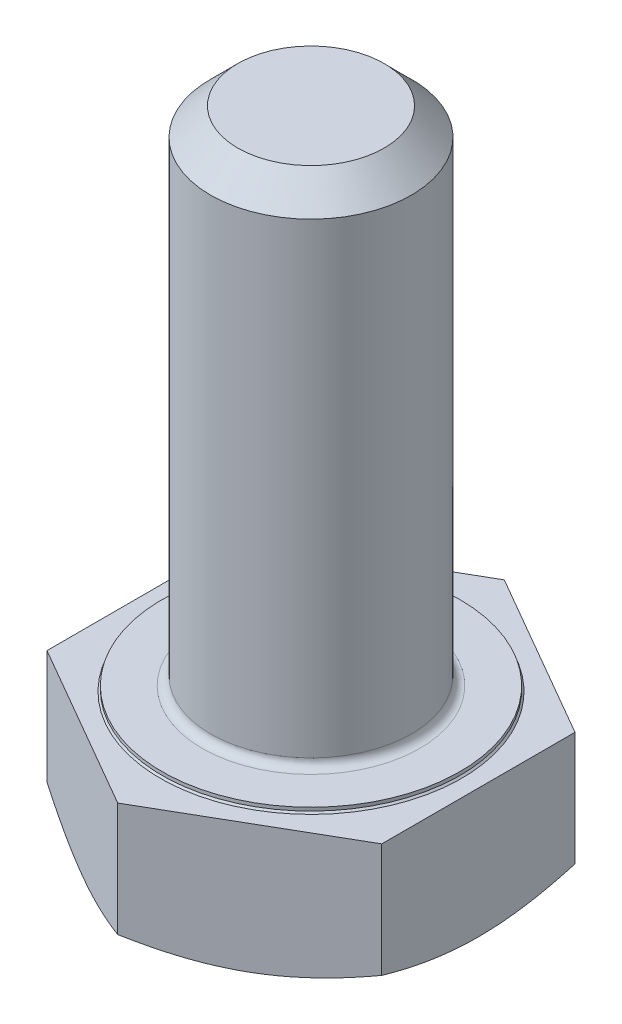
ISO-10303-21;
HEADER;
FILE_DESCRIPTION(('STEP AP214'),'2;1');
FILE_NAME('part.step','',(''),(''),'','','');
FILE_SCHEMA(('AUTOMOTIVE_DESIGN { 1 0 10303 214 1 1 1 1 }'));
ENDSEC;
DATA;
#1=APPLICATION_CONTEXT('core data for automotive mechanical design processes');
#2=APPLICATION_PROTOCOL_DEFINITION('international standard','automotive_design',2000,#1);
#3=PRODUCT_CONTEXT('',#1,'mechanical');
#4=PRODUCT('Part','Part','',(#3));
#5=PRODUCT_RELATED_PRODUCT_CATEGORY('part','',(#4));
#6=PRODUCT_DEFINITION_FORMATION('','',#4);
#7=PRODUCT_DEFINITION_CONTEXT('part definition',#1,'design');
#8=PRODUCT_DEFINITION('design','',#6,#7);
#9=PRODUCT_DEFINITION_SHAPE('','',#8);
#10=(LENGTH_UNIT() NAMED_UNIT(*) SI_UNIT(.MILLI.,.METRE.));
#11=(NAMED_UNIT(*) PLANE_ANGLE_UNIT() SI_UNIT($,.RADIAN.));
#12=(NAMED_UNIT(*) SI_UNIT($,.STERADIAN.) SOLID_ANGLE_UNIT());
#13=UNCERTAINTY_MEASURE_WITH_UNIT(LENGTH_MEASURE(1.E-05),#10,'distance_accuracy_value','');
#14=(GEOMETRIC_REPRESENTATION_CONTEXT(3) GLOBAL_UNCERTAINTY_ASSIGNED_CONTEXT((#13)) GLOBAL_UNIT_ASSIGNED_CONTEXT((#10,
#11,#12)) REPRESENTATION_CONTEXT('',''));
#15=CARTESIAN_POINT('',(0.,0.,0.));
#16=DIRECTION('',(0.,0.,1.));
#17=DIRECTION('',(1.,0.,0.));
#18=AXIS2_PLACEMENT_3D('',#15,#16,#17);
#19=CARTESIAN_POINT('',(0.,-4.,0.));
#20=DIRECTION('',(0.,-1.,0.));
#21=DIRECTION('',(0.,0.,-1.));
#22=AXIS2_PLACEMENT_3D('',#19,#20,#21);
#23=PLANE('',#22);
#24=CARTESIAN_POINT('',(0.,-4.00000000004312,0.));
#25=DIRECTION('',(0.,1.,0.));
#26=DIRECTION('',(0.,0.,1.));
#27=AXIS2_PLACEMENT_3D('',#24,#25,#26);
#28=CIRCLE('',#27,4.99999999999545);
#29=CARTESIAN_POINT('',(-4.99999999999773,-4.00000000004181,0.));
#30=VERTEX_POINT('',#29);
#31=CARTESIAN_POINT('',(-2.50000000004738,-4.00000000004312,4.33012701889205));
#32=VERTEX_POINT('',#31);
#33=EDGE_CURVE('E174',#30,#32,#28,.T.);
#34=ORIENTED_EDGE('',*,*,#33,.F.);
#35=CARTESIAN_POINT('',(0.,-4.00000000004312,0.));
#36=DIRECTION('',(0.,1.,0.));
#37=DIRECTION('',(0.,0.,1.));
#38=AXIS2_PLACEMENT_3D('',#35,#36,#37);
#39=CIRCLE('',#38,4.99999999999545);
#40=CARTESIAN_POINT('',(-2.50000000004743,-4.00000000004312,-4.33012701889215));
#41=VERTEX_POINT('',#40);
#42=EDGE_CURVE('E59',#41,#30,#39,.T.);
#43=ORIENTED_EDGE('',*,*,#42,.F.);
#44=CARTESIAN_POINT('',(0.,-4.00000000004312,0.));
#45=DIRECTION('',(0.,1.,0.));
#46=DIRECTION('',(0.,0.,1.));
#47=AXIS2_PLACEMENT_3D('',#44,#45,#46);
#48=CIRCLE('',#47,4.99999999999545);
#49=CARTESIAN_POINT('',(2.50000000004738,-4.00000000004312,-4.33012701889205));
#50=VERTEX_POINT('',#49);
#51=EDGE_CURVE('E76',#50,#41,#48,.T.);
#52=ORIENTED_EDGE('',*,*,#51,.F.);
#53=CARTESIAN_POINT('',(0.,-4.00000000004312,0.));
#54=DIRECTION('',(0.,1.,0.));
#55=DIRECTION('',(0.,0.,1.));
#56=AXIS2_PLACEMENT_3D('',#53,#54,#55);
#57=CIRCLE('',#56,4.99999999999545);
#58=CARTESIAN_POINT('',(4.99999999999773,-4.00000000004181,0.));
#59=VERTEX_POINT('',#58);
#60=EDGE_CURVE('E74',#59,#50,#57,.T.);
#61=ORIENTED_EDGE('',*,*,#60,.F.);
#62=CARTESIAN_POINT('',(0.,-4.00000000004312,0.));
#63=DIRECTION('',(0.,1.,0.));
#64=DIRECTION('',(0.,0.,1.));
#65=AXIS2_PLACEMENT_3D('',#62,#63,#64);
#66=CIRCLE('',#65,4.99999999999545);
#67=CARTESIAN_POINT('',(2.50000000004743,-4.00000000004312,4.33012701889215));
#68=VERTEX_POINT('',#67);
#69=EDGE_CURVE('E175',#68,#59,#66,.T.);
#70=ORIENTED_EDGE('',*,*,#69,.F.);
#71=CARTESIAN_POINT('',(0.,-4.00000000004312,0.));
#72=DIRECTION('',(0.,1.,0.));
#73=DIRECTION('',(0.,0.,1.));
#74=AXIS2_PLACEMENT_3D('',#71,#72,#73);
#75=CIRCLE('',#74,4.99999999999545);
#76=EDGE_CURVE('E170',#32,#68,#75,.T.);
#77=ORIENTED_EDGE('',*,*,#76,.F.);
#78=EDGE_LOOP('',(#34,#43,#52,#61,#70,#77));
#79=FACE_BOUND('',#78,.T.);
#80=ADVANCED_FACE('F42',(#79),#23,.T.);
#81=CARTESIAN_POINT('',(0.,-3.55073852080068,0.));
#82=DIRECTION('',(0.,1.,0.));
#83=DIRECTION('',(0.,0.,1.));
#84=AXIS2_PLACEMENT_3D('',#81,#82,#83);
#85=CONICAL_SURFACE('',#84,5.7781437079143,1.04719755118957);
#86=CARTESIAN_POINT('',(5.00000000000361,-3.55341801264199,-2.88675134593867));
#87=CARTESIAN_POINT('',(4.79650106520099,-3.62126800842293,-3.00424151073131));
#88=CARTESIAN_POINT('',(4.59137243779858,-3.68343045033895,-3.1226725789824));
#89=CARTESIAN_POINT('',(4.17930699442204,-3.79305279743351,-3.36057867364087));
#90=CARTESIAN_POINT('',(3.97238455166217,-3.84058540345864,-3.48004540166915));
#91=CARTESIAN_POINT('',(3.66004804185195,-3.89894737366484,-3.66037296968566));
#92=CARTESIAN_POINT('',(3.55554132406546,-3.91625229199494,-3.72070995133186));
#93=CARTESIAN_POINT('',(3.34602757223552,-3.94620746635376,-3.84167277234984));
#94=CARTESIAN_POINT('',(3.24102055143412,-3.9588578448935,-3.90229860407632));
#95=CARTESIAN_POINT('',(3.03011778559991,-3.97928167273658,-4.02406337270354));
#96=CARTESIAN_POINT('',(2.92422022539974,-3.9870303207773,-4.08520335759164));
#97=CARTESIAN_POINT('',(2.71221683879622,-3.99740020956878,-4.2076035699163));
#98=CARTESIAN_POINT('',(2.60611097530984,-4.00002043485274,-4.26886381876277));
#99=CARTESIAN_POINT('',(2.50000000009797,-4.00000000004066,-4.33012701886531));
#100=B_SPLINE_CURVE_WITH_KNOTS('',3,(#86,#87,#88,#89,#90,#91,#92,#93,#94,#95,#96,#97,#98,#99),
.UNSPECIFIED.,.F.,.F.,(4,2,2,2,2,2,4),(0.,0.73403665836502,1.46436443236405,1.83000749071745,
2.19564092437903,2.56310985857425,2.93065154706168),.UNSPECIFIED.);
#101=CARTESIAN_POINT('',(5.,-3.55341801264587,-2.886751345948));
#102=VERTEX_POINT('',#101);
#103=EDGE_CURVE('E159',#102,#50,#100,.T.);
#104=ORIENTED_EDGE('',*,*,#103,.F.);
#105=CARTESIAN_POINT('',(4.99999999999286,-4.00000000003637,0.));
#106=CARTESIAN_POINT('',(4.99999999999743,-4.0000204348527,-0.122526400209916));
#107=CARTESIAN_POINT('',(4.99999999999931,-3.99740020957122,-0.245046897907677));
#108=CARTESIAN_POINT('',(5.00000000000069,-3.98703032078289,-0.489847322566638));
#109=CARTESIAN_POINT('',(5.00000000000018,-3.97928167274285,-0.612127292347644));
#110=CARTESIAN_POINT('',(4.99999999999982,-3.95885784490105,-0.855656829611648));
#111=CARTESIAN_POINT('',(4.99999999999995,-3.9462074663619,-0.976908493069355));
#112=CARTESIAN_POINT('',(5.00000000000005,-3.91625229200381,-1.21883413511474));
#113=CARTESIAN_POINT('',(5.00000000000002,-3.89894737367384,-1.33950809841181));
#114=CARTESIAN_POINT('',(4.99999999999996,-3.84058540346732,-1.700163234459));
#115=CARTESIAN_POINT('',(4.99999999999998,-3.79305279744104,-1.9390966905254));
#116=CARTESIAN_POINT('',(5.00000000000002,-3.68343045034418,-2.41490887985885));
#117=CARTESIAN_POINT('',(5.00000000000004,-3.621268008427,-2.65177101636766));
#118=CARTESIAN_POINT('',(5.,-3.55341801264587,-2.88675134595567));
#119=B_SPLINE_CURVE_WITH_KNOTS('',3,(#105,#106,#107,#108,#109,#110,#111,#112,#113,#114,#115,
#116,#117,#118),.UNSPECIFIED.,.F.,.F.,(4,2,2,2,2,2,4),(0.,0.36754168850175,0.735010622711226,
1.10064405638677,1.46628711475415,2.19661488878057,2.93065154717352),.UNSPECIFIED.);
#120=EDGE_CURVE('E309',#59,#102,#119,.T.);
#121=ORIENTED_EDGE('',*,*,#120,.F.);
#122=ORIENTED_EDGE('',*,*,#60,.T.);
#123=EDGE_LOOP('',(#104,#121,#122));
#124=FACE_BOUND('',#123,.T.);
#125=ADVANCED_FACE('F315',(#124),#85,.T.);
#126=CARTESIAN_POINT('',(0.,-3.55073852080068,0.));
#127=DIRECTION('',(0.,1.,0.));
#128=DIRECTION('',(0.,0.,1.));
#129=AXIS2_PLACEMENT_3D('',#126,#127,#128);
#130=CONICAL_SURFACE('',#129,5.7781437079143,1.04719755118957);
#131=CARTESIAN_POINT('',(4.99999999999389,-3.55341801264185,2.88675134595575));
#132=CARTESIAN_POINT('',(4.99999999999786,-3.62126800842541,2.6517710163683));
#133=CARTESIAN_POINT('',(4.99999999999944,-3.6834304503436,2.41490887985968));
#134=CARTESIAN_POINT('',(5.00000000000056,-3.79305279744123,1.93909669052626));
#135=CARTESIAN_POINT('',(5.0000000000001,-3.84058540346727,1.70016323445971));
#136=CARTESIAN_POINT('',(4.99999999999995,-3.8989473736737,1.33950809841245));
#137=CARTESIAN_POINT('',(4.99999999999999,-3.91625229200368,1.21883413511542));
#138=CARTESIAN_POINT('',(5.00000000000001,-3.94620746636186,0.9769084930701));
#139=CARTESIAN_POINT('',(5.,-3.95885784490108,0.85565682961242));
#140=CARTESIAN_POINT('',(5.,-3.97928167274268,0.61212729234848));
#141=CARTESIAN_POINT('',(5.,-3.98703032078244,0.489847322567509));
#142=CARTESIAN_POINT('',(5.,-3.99740020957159,0.245046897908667));
#143=CARTESIAN_POINT('',(5.,-4.00002043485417,0.122526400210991));
#144=CARTESIAN_POINT('',(5.,-4.0000000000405,1.19058183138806E-12));
#145=B_SPLINE_CURVE_WITH_KNOTS('',3,(#131,#132,#133,#134,#135,#136,#137,#138,#139,#140,#141,
#142,#143,#144),.UNSPECIFIED.,.F.,.F.,(4,2,2,2,2,2,4),(0.,0.734036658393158,1.46436443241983,
1.83000749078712,2.19564092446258,2.56310985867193,2.9306515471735),.UNSPECIFIED.);
#146=CARTESIAN_POINT('',(5.,-3.55341801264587,2.886751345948));
#147=VERTEX_POINT('',#146);
#148=EDGE_CURVE('E269',#147,#59,#145,.T.);
#149=ORIENTED_EDGE('',*,*,#148,.F.);
#150=CARTESIAN_POINT('',(2.50000000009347,-4.0000000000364,4.33012701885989));
#151=CARTESIAN_POINT('',(2.60611097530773,-4.00002043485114,4.26886381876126));
#152=CARTESIAN_POINT('',(2.71221683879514,-3.99740020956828,4.20760356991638));
#153=CARTESIAN_POINT('',(2.92422022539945,-3.98703032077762,4.08520335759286));
#154=CARTESIAN_POINT('',(3.0301177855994,-3.97928167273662,4.02406337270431));
#155=CARTESIAN_POINT('',(3.24102055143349,-3.95885784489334,3.90229860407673));
#156=CARTESIAN_POINT('',(3.34602757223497,-3.94620746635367,3.84167277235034));
#157=CARTESIAN_POINT('',(3.55554132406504,-3.91625229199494,3.72070995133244));
#158=CARTESIAN_POINT('',(3.66004804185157,-3.89894737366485,3.66037296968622));
#159=CARTESIAN_POINT('',(3.97238455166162,-3.84058540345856,3.48004540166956));
#160=CARTESIAN_POINT('',(4.17930699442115,-3.7930527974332,3.36057867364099));
#161=CARTESIAN_POINT('',(4.5913724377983,-3.6834304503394,3.12267257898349));
#162=CARTESIAN_POINT('',(4.79650106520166,-3.62126800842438,3.00424151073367));
#163=CARTESIAN_POINT('',(5.00000000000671,-3.55341801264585,2.88675134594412));
#164=B_SPLINE_CURVE_WITH_KNOTS('',3,(#150,#151,#152,#153,#154,#155,#156,#157,#158,#159,#160,
#161,#162,#163),.UNSPECIFIED.,.F.,.F.,(4,2,2,2,2,2,4),(0.,0.367541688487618,0.735010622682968,
1.10064405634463,1.46628711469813,2.19661488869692,2.93065154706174),.UNSPECIFIED.);
#165=EDGE_CURVE('E244',#68,#147,#164,.T.);
#166=ORIENTED_EDGE('',*,*,#165,.F.);
#167=ORIENTED_EDGE('',*,*,#69,.T.);
#168=EDGE_LOOP('',(#149,#166,#167));
#169=FACE_BOUND('',#168,.T.);
#170=ADVANCED_FACE('F277',(#169),#130,.T.);
#171=CARTESIAN_POINT('',(0.,-3.55073852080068,0.));
#172=DIRECTION('',(0.,1.,0.));
#173=DIRECTION('',(0.,0.,1.));
#174=AXIS2_PLACEMENT_3D('',#171,#172,#173);
#175=CONICAL_SURFACE('',#174,5.7781437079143,1.04719755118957);
#176=CARTESIAN_POINT('',(-9.70357000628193E-12,-3.55341801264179,5.7735026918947));
#177=CARTESIAN_POINT('',(0.203498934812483,-3.621268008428,5.65601252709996));
#178=CARTESIAN_POINT('',(0.408627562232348,-3.68343045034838,5.53758145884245));
#179=CARTESIAN_POINT('',(0.820693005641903,-3.7930527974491,5.29967536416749));
#180=CARTESIAN_POINT('',(1.02761544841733,-3.84058540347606,5.18020863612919));
#181=CARTESIAN_POINT('',(1.33995195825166,-3.89894737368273,4.9998810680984));
#182=CARTESIAN_POINT('',(1.44445867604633,-3.9162522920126,4.93954408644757));
#183=CARTESIAN_POINT('',(1.65397242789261,-3.94620746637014,4.81858126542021));
#184=CARTESIAN_POINT('',(1.75897944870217,-3.95885784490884,4.757955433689));
#185=CARTESIAN_POINT('',(1.96988221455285,-3.97928167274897,4.63619066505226));
#186=CARTESIAN_POINT('',(2.07577977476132,-3.98703032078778,4.57505068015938));
#187=CARTESIAN_POINT('',(2.28778316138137,-3.99740020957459,4.45265046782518));
#188=CARTESIAN_POINT('',(2.39388902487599,-4.00002043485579,4.39139021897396));
#189=CARTESIAN_POINT('',(2.50000000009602,-4.00000000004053,4.33012701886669));
#190=B_SPLINE_CURVE_WITH_KNOTS('',3,(#176,#177,#178,#179,#180,#181,#182,#183,#184,#185,#186,
#187,#188,#189),.UNSPECIFIED.,.F.,.F.,(4,2,2,2,2,2,4),(0.,0.734036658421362,1.46436443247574,
1.83000749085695,2.19564092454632,2.56310985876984,2.93065154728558),.UNSPECIFIED.);
#191=CARTESIAN_POINT('',(0.,-3.55341801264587,5.77350269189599));
#192=VERTEX_POINT('',#191);
#193=EDGE_CURVE('E287',#192,#68,#190,.T.);
#194=ORIENTED_EDGE('',*,*,#193,.F.);
#195=CARTESIAN_POINT('',(-2.50000000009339,-4.00000000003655,4.33012701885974));
#196=CARTESIAN_POINT('',(-2.39388902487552,-4.00002043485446,4.39139021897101));
#197=CARTESIAN_POINT('',(-2.28778316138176,-3.99740020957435,4.4526504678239));
#198=CARTESIAN_POINT('',(-2.07577977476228,-3.98703032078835,4.57505068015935));
#199=CARTESIAN_POINT('',(-1.96988221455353,-3.97928167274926,4.63619066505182));
#200=CARTESIAN_POINT('',(-1.7589794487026,-3.95885784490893,4.75795543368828));
#201=CARTESIAN_POINT('',(-1.65397242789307,-3.94620746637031,4.81858126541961));
#202=CARTESIAN_POINT('',(-1.44445867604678,-3.91625229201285,4.93954408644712));
#203=CARTESIAN_POINT('',(-1.33995195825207,-3.89894737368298,4.99988106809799));
#204=CARTESIAN_POINT('',(-1.02761544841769,-3.84058540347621,5.18020863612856));
#205=CARTESIAN_POINT('',(-0.820693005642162,-3.793052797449,5.29967536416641));
#206=CARTESIAN_POINT('',(-0.40862756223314,-3.68343045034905,5.53758145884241));
#207=CARTESIAN_POINT('',(-0.20349893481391,-3.62126800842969,5.65601252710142));
#208=CARTESIAN_POINT('',(6.78572330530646E-12,-3.55341801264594,5.77350269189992));
#209=B_SPLINE_CURVE_WITH_KNOTS('',3,(#195,#196,#197,#198,#199,#200,#201,#202,#203,#204,#205,
#206,#207,#208),.UNSPECIFIED.,.F.,.F.,(4,2,2,2,2,2,4),(0.,0.367541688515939,0.735010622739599,
1.10064405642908,1.4662871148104,2.19661488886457,2.93065154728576),.UNSPECIFIED.);
#210=EDGE_CURVE('E243',#32,#192,#209,.T.);
#211=ORIENTED_EDGE('',*,*,#210,.F.);
#212=ORIENTED_EDGE('',*,*,#76,.T.);
#213=EDGE_LOOP('',(#194,#211,#212));
#214=FACE_BOUND('',#213,.T.);
#215=ADVANCED_FACE('F273',(#214),#175,.T.);
#216=CARTESIAN_POINT('',(0.,-3.55073852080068,0.));
#217=DIRECTION('',(0.,1.,0.));
#218=DIRECTION('',(0.,0.,1.));
#219=AXIS2_PLACEMENT_3D('',#216,#217,#218);
#220=CONICAL_SURFACE('',#219,5.7781437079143,1.04719755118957);
#221=CARTESIAN_POINT('',(-5.00000000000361,-3.55341801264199,2.88675134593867));
#222=CARTESIAN_POINT('',(-4.79650106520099,-3.62126800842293,3.00424151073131));
#223=CARTESIAN_POINT('',(-4.59137243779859,-3.68343045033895,3.1226725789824));
#224=CARTESIAN_POINT('',(-4.17930699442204,-3.79305279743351,3.36057867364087));
#225=CARTESIAN_POINT('',(-3.97238455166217,-3.84058540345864,3.48004540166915));
#226=CARTESIAN_POINT('',(-3.66004804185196,-3.89894737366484,3.66037296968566));
#227=CARTESIAN_POINT('',(-3.55554132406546,-3.91625229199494,3.72070995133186));
#228=CARTESIAN_POINT('',(-3.34602757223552,-3.94620746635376,3.84167277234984));
#229=CARTESIAN_POINT('',(-3.24102055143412,-3.9588578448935,3.90229860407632));
#230=CARTESIAN_POINT('',(-3.03011778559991,-3.97928167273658,4.02406337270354));
#231=CARTESIAN_POINT('',(-2.92422022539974,-3.9870303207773,4.08520335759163));
#232=CARTESIAN_POINT('',(-2.71221683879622,-3.99740020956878,4.2076035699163));
#233=CARTESIAN_POINT('',(-2.60611097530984,-4.00002043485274,4.26886381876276));
#234=CARTESIAN_POINT('',(-2.50000000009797,-4.00000000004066,4.33012701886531));
#235=B_SPLINE_CURVE_WITH_KNOTS('',3,(#221,#222,#223,#224,#225,#226,#227,#228,#229,#230,#231,
#232,#233,#234),.UNSPECIFIED.,.F.,.F.,(4,2,2,2,2,2,4),(0.,0.734036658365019,1.46436443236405,
1.83000749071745,2.19564092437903,2.56310985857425,2.93065154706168),.UNSPECIFIED.);
#236=CARTESIAN_POINT('',(-5.,-3.55341801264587,2.8867513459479));
#237=VERTEX_POINT('',#236);
#238=EDGE_CURVE('E239',#237,#32,#235,.T.);
#239=ORIENTED_EDGE('',*,*,#238,.F.);
#240=CARTESIAN_POINT('',(-4.99999999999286,-4.00000000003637,0.));
#241=CARTESIAN_POINT('',(-4.99999999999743,-4.0000204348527,0.122526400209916));
#242=CARTESIAN_POINT('',(-4.99999999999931,-3.99740020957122,0.245046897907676));
#243=CARTESIAN_POINT('',(-5.00000000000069,-3.98703032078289,0.489847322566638));
#244=CARTESIAN_POINT('',(-5.00000000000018,-3.97928167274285,0.612127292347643));
#245=CARTESIAN_POINT('',(-4.99999999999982,-3.95885784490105,0.855656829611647));
#246=CARTESIAN_POINT('',(-4.99999999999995,-3.9462074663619,0.976908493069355));
#247=CARTESIAN_POINT('',(-5.00000000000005,-3.91625229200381,1.21883413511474));
#248=CARTESIAN_POINT('',(-5.00000000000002,-3.89894737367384,1.33950809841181));
#249=CARTESIAN_POINT('',(-4.99999999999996,-3.84058540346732,1.700163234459));
#250=CARTESIAN_POINT('',(-4.99999999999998,-3.79305279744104,1.9390966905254));
#251=CARTESIAN_POINT('',(-5.00000000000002,-3.68343045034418,2.41490887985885));
#252=CARTESIAN_POINT('',(-5.00000000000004,-3.621268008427,2.65177101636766));
#253=CARTESIAN_POINT('',(-5.,-3.55341801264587,2.88675134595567));
#254=B_SPLINE_CURVE_WITH_KNOTS('',3,(#240,#241,#242,#243,#244,#245,#246,#247,#248,#249,#250,
#251,#252,#253),.UNSPECIFIED.,.F.,.F.,(4,2,2,2,2,2,4),(0.,0.36754168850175,0.735010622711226,
1.10064405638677,1.46628711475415,2.19661488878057,2.93065154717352),.UNSPECIFIED.);
#255=EDGE_CURVE('E250',#30,#237,#254,.T.);
#256=ORIENTED_EDGE('',*,*,#255,.F.);
#257=ORIENTED_EDGE('',*,*,#33,.T.);
#258=EDGE_LOOP('',(#239,#256,#257));
#259=FACE_BOUND('',#258,.T.);
#260=ADVANCED_FACE('F207',(#259),#220,.T.);
#261=CARTESIAN_POINT('',(0.,-3.55073852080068,0.));
#262=DIRECTION('',(0.,1.,0.));
#263=DIRECTION('',(0.,0.,1.));
#264=AXIS2_PLACEMENT_3D('',#261,#262,#263);
#265=CONICAL_SURFACE('',#264,5.7781437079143,1.04719755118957);
#266=CARTESIAN_POINT('',(9.67539593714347E-12,-3.55341801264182,-5.77350269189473));
#267=CARTESIAN_POINT('',(-0.203498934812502,-3.62126800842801,-5.65601252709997));
#268=CARTESIAN_POINT('',(-0.408627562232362,-3.68343045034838,-5.53758145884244));
#269=CARTESIAN_POINT('',(-0.820693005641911,-3.7930527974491,-5.29967536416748));
#270=CARTESIAN_POINT('',(-1.02761544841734,-3.84058540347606,-5.18020863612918));
#271=CARTESIAN_POINT('',(-1.33995195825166,-3.89894737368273,-4.9998810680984));
#272=CARTESIAN_POINT('',(-1.44445867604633,-3.9162522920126,-4.93954408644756));
#273=CARTESIAN_POINT('',(-1.65397242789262,-3.94620746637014,-4.81858126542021));
#274=CARTESIAN_POINT('',(-1.75897944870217,-3.95885784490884,-4.757955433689));
#275=CARTESIAN_POINT('',(-1.96988221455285,-3.97928167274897,-4.63619066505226));
#276=CARTESIAN_POINT('',(-2.07577977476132,-3.98703032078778,-4.57505068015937));
#277=CARTESIAN_POINT('',(-2.28778316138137,-3.99740020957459,-4.45265046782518));
#278=CARTESIAN_POINT('',(-2.39388902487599,-4.00002043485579,-4.39139021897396));
#279=CARTESIAN_POINT('',(-2.50000000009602,-4.00000000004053,-4.33012701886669));
#280=B_SPLINE_CURVE_WITH_KNOTS('',3,(#266,#267,#268,#269,#270,#271,#272,#273,#274,#275,#276,
#277,#278,#279),.UNSPECIFIED.,.F.,.F.,(4,2,2,2,2,2,4),(0.,0.734036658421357,1.46436443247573,
1.83000749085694,2.19564092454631,2.56310985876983,2.93065154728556),.UNSPECIFIED.);
#281=CARTESIAN_POINT('',(0.,-3.55341801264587,-5.773502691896));
#282=VERTEX_POINT('',#281);
#283=EDGE_CURVE('E196',#282,#41,#280,.T.);
#284=ORIENTED_EDGE('',*,*,#283,.F.);
#285=CARTESIAN_POINT('',(2.50000000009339,-4.00000000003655,-4.33012701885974));
#286=CARTESIAN_POINT('',(2.39388902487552,-4.00002043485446,-4.39139021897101));
#287=CARTESIAN_POINT('',(2.28778316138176,-3.99740020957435,-4.4526504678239));
#288=CARTESIAN_POINT('',(2.07577977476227,-3.98703032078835,-4.57505068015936));
#289=CARTESIAN_POINT('',(1.96988221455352,-3.97928167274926,-4.63619066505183));
#290=CARTESIAN_POINT('',(1.75897944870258,-3.95885784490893,-4.75795543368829));
#291=CARTESIAN_POINT('',(1.65397242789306,-3.94620746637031,-4.81858126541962));
#292=CARTESIAN_POINT('',(1.44445867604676,-3.91625229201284,-4.93954408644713));
#293=CARTESIAN_POINT('',(1.33995195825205,-3.89894737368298,-4.999881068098));
#294=CARTESIAN_POINT('',(1.02761544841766,-3.84058540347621,-5.18020863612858));
#295=CARTESIAN_POINT('',(0.820693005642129,-3.793052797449,-5.29967536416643));
#296=CARTESIAN_POINT('',(0.408627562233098,-3.68343045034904,-5.53758145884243));
#297=CARTESIAN_POINT('',(0.203498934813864,-3.62126800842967,-5.65601252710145));
#298=CARTESIAN_POINT('',(-6.83455675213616E-12,-3.55341801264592,-5.77350269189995));
#299=B_SPLINE_CURVE_WITH_KNOTS('',3,(#285,#286,#287,#288,#289,#290,#291,#292,#293,#294,#295,
#296,#297,#298),.UNSPECIFIED.,.F.,.F.,(4,2,2,2,2,2,4),(0.,0.367541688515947,0.735010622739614,
1.1006440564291,1.46628711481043,2.19661488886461,2.93065154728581),.UNSPECIFIED.);
#300=EDGE_CURVE('E144',#50,#282,#299,.T.);
#301=ORIENTED_EDGE('',*,*,#300,.F.);
#302=ORIENTED_EDGE('',*,*,#51,.T.);
#303=EDGE_LOOP('',(#284,#301,#302));
#304=FACE_BOUND('',#303,.T.);
#305=ADVANCED_FACE('F202',(#304),#265,.T.);
#306=CARTESIAN_POINT('',(0.,-3.55073852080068,0.));
#307=DIRECTION('',(0.,1.,0.));
#308=DIRECTION('',(0.,0.,1.));
#309=AXIS2_PLACEMENT_3D('',#306,#307,#308);
#310=CONICAL_SURFACE('',#309,5.7781437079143,1.04719755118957);
#311=CARTESIAN_POINT('',(-4.99999999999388,-3.55341801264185,-2.88675134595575));
#312=CARTESIAN_POINT('',(-4.99999999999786,-3.62126800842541,-2.6517710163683));
#313=CARTESIAN_POINT('',(-4.99999999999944,-3.6834304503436,-2.41490887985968));
#314=CARTESIAN_POINT('',(-5.00000000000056,-3.79305279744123,-1.93909669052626));
#315=CARTESIAN_POINT('',(-5.0000000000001,-3.84058540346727,-1.70016323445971));
#316=CARTESIAN_POINT('',(-4.99999999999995,-3.8989473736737,-1.33950809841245));
#317=CARTESIAN_POINT('',(-4.99999999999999,-3.91625229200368,-1.21883413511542));
#318=CARTESIAN_POINT('',(-5.00000000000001,-3.94620746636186,-0.9769084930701));
#319=CARTESIAN_POINT('',(-5.,-3.95885784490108,-0.855656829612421));
#320=CARTESIAN_POINT('',(-5.,-3.97928167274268,-0.612127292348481));
#321=CARTESIAN_POINT('',(-5.,-3.98703032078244,-0.48984732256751));
#322=CARTESIAN_POINT('',(-5.,-3.99740020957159,-0.245046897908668));
#323=CARTESIAN_POINT('',(-5.,-4.00002043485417,-0.122526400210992));
#324=CARTESIAN_POINT('',(-5.,-4.0000000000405,-1.19123229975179E-12));
#325=B_SPLINE_CURVE_WITH_KNOTS('',3,(#311,#312,#313,#314,#315,#316,#317,#318,#319,#320,#321,
#322,#323,#324),.UNSPECIFIED.,.F.,.F.,(4,2,2,2,2,2,4),(0.,0.734036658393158,1.46436443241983,
1.83000749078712,2.19564092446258,2.56310985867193,2.9306515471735),.UNSPECIFIED.);
#326=CARTESIAN_POINT('',(-5.,-3.55341801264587,-2.886751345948));
#327=VERTEX_POINT('',#326);
#328=EDGE_CURVE('E219',#327,#30,#325,.T.);
#329=ORIENTED_EDGE('',*,*,#328,.F.);
#330=CARTESIAN_POINT('',(-2.50000000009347,-4.0000000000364,-4.33012701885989));
#331=CARTESIAN_POINT('',(-2.60611097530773,-4.00002043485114,-4.26886381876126));
#332=CARTESIAN_POINT('',(-2.71221683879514,-3.99740020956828,-4.20760356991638));
#333=CARTESIAN_POINT('',(-2.92422022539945,-3.98703032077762,-4.08520335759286));
#334=CARTESIAN_POINT('',(-3.0301177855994,-3.97928167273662,-4.02406337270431));
#335=CARTESIAN_POINT('',(-3.24102055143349,-3.95885784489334,-3.90229860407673));
#336=CARTESIAN_POINT('',(-3.34602757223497,-3.94620746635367,-3.84167277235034));
#337=CARTESIAN_POINT('',(-3.55554132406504,-3.91625229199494,-3.72070995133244));
#338=CARTESIAN_POINT('',(-3.66004804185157,-3.89894737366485,-3.66037296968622));
#339=CARTESIAN_POINT('',(-3.97238455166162,-3.84058540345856,-3.48004540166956));
#340=CARTESIAN_POINT('',(-4.17930699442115,-3.7930527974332,-3.36057867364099));
#341=CARTESIAN_POINT('',(-4.5913724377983,-3.6834304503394,-3.12267257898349));
#342=CARTESIAN_POINT('',(-4.79650106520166,-3.62126800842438,-3.00424151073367));
#343=CARTESIAN_POINT('',(-5.00000000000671,-3.55341801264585,-2.88675134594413));
#344=B_SPLINE_CURVE_WITH_KNOTS('',3,(#330,#331,#332,#333,#334,#335,#336,#337,#338,#339,#340,
#341,#342,#343),.UNSPECIFIED.,.F.,.F.,(4,2,2,2,2,2,4),(0.,0.367541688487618,0.735010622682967,
1.10064405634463,1.46628711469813,2.19661488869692,2.93065154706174),.UNSPECIFIED.);
#345=EDGE_CURVE('E238',#41,#327,#344,.T.);
#346=ORIENTED_EDGE('',*,*,#345,.F.);
#347=ORIENTED_EDGE('',*,*,#42,.T.);
#348=EDGE_LOOP('',(#329,#346,#347));
#349=FACE_BOUND('',#348,.T.);
#350=ADVANCED_FACE('F206',(#349),#310,.T.);
#351=CARTESIAN_POINT('',(0.,0.,-5.773502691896));
#352=DIRECTION('',(0.500000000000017,0.,-0.866025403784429));
#353=DIRECTION('',(-0.866025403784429,0.,-0.500000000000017));
#354=AXIS2_PLACEMENT_3D('',#351,#352,#353);
#355=PLANE('',#354);
#356=ORIENTED_EDGE('',*,*,#300,.T.);
#357=DIRECTION('',(0.,-1.,0.));
#358=VECTOR('',#357,1.);
#359=CARTESIAN_POINT('',(0.,-0.15,-5.773502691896));
#360=LINE('',#359,#358);
#361=CARTESIAN_POINT('',(0.,-0.15,-5.773502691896));
#362=VERTEX_POINT('',#361);
#363=EDGE_CURVE('E140',#362,#282,#360,.T.);
#364=ORIENTED_EDGE('',*,*,#363,.F.);
#365=DIRECTION('',(-0.866025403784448,0.,-0.499999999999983));
#366=VECTOR('',#365,1.);
#367=CARTESIAN_POINT('',(0.,-0.15,-5.773502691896));
#368=LINE('',#367,#366);
#369=CARTESIAN_POINT('',(5.,-0.15,-2.886751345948));
#370=VERTEX_POINT('',#369);
#371=EDGE_CURVE('E129',#370,#362,#368,.T.);
#372=ORIENTED_EDGE('',*,*,#371,.F.);
#373=DIRECTION('',(0.,-1.,0.));
#374=VECTOR('',#373,1.);
#375=CARTESIAN_POINT('',(5.,-0.15,-2.886751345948));
#376=LINE('',#375,#374);
#377=EDGE_CURVE('E148',#370,#102,#376,.T.);
#378=ORIENTED_EDGE('',*,*,#377,.T.);
#379=ORIENTED_EDGE('',*,*,#103,.T.);
#380=EDGE_LOOP('',(#356,#364,#372,#378,#379));
#381=FACE_BOUND('',#380,.T.);
#382=ADVANCED_FACE('F141',(#381),#355,.T.);
#383=CARTESIAN_POINT('',(5.,0.,-2.886751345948));
#384=DIRECTION('',(1.,0.,0.));
#385=DIRECTION('',(0.,0.,-1.));
#386=AXIS2_PLACEMENT_3D('',#383,#384,#385);
#387=PLANE('',#386);
#388=ORIENTED_EDGE('',*,*,#120,.T.);
#389=ORIENTED_EDGE('',*,*,#377,.F.);
#390=DIRECTION('',(0.,0.,-1.));
#391=VECTOR('',#390,1.);
#392=CARTESIAN_POINT('',(5.,-0.15,-2.886751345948));
#393=LINE('',#392,#391);
#394=CARTESIAN_POINT('',(5.,-0.15,2.886751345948));
#395=VERTEX_POINT('',#394);
#396=EDGE_CURVE('E135',#395,#370,#393,.T.);
#397=ORIENTED_EDGE('',*,*,#396,.F.);
#398=DIRECTION('',(0.,-1.,0.));
#399=VECTOR('',#398,1.);
#400=CARTESIAN_POINT('',(5.,-0.15,2.886751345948));
#401=LINE('',#400,#399);
#402=EDGE_CURVE('E703',#395,#147,#401,.T.);
#403=ORIENTED_EDGE('',*,*,#402,.T.);
#404=ORIENTED_EDGE('',*,*,#148,.T.);
#405=EDGE_LOOP('',(#388,#389,#397,#403,#404));
#406=FACE_BOUND('',#405,.T.);
#407=ADVANCED_FACE('F313',(#406),#387,.T.);
#408=CARTESIAN_POINT('',(5.,0.,2.886751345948));
#409=DIRECTION('',(0.500000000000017,0.,0.866025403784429));
#410=DIRECTION('',(0.866025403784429,0.,-0.500000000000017));
#411=AXIS2_PLACEMENT_3D('',#408,#409,#410);
#412=PLANE('',#411);
#413=ORIENTED_EDGE('',*,*,#165,.T.);
#414=ORIENTED_EDGE('',*,*,#402,.F.);
#415=DIRECTION('',(0.866025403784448,0.,-0.499999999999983));
#416=VECTOR('',#415,1.);
#417=CARTESIAN_POINT('',(5.,-0.15,2.886751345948));
#418=LINE('',#417,#416);
#419=CARTESIAN_POINT('',(0.,-0.15,5.77350269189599));
#420=VERTEX_POINT('',#419);
#421=EDGE_CURVE('E122',#420,#395,#418,.T.);
#422=ORIENTED_EDGE('',*,*,#421,.F.);
#423=DIRECTION('',(0.,-1.,0.));
#424=VECTOR('',#423,1.);
#425=CARTESIAN_POINT('',(0.,-0.15,5.77350269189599));
#426=LINE('',#425,#424);
#427=EDGE_CURVE('E183',#420,#192,#426,.T.);
#428=ORIENTED_EDGE('',*,*,#427,.T.);
#429=ORIENTED_EDGE('',*,*,#193,.T.);
#430=EDGE_LOOP('',(#413,#414,#422,#428,#429));
#431=FACE_BOUND('',#430,.T.);
#432=ADVANCED_FACE('F258',(#431),#412,.T.);
#433=CARTESIAN_POINT('',(0.,0.,5.773502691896));
#434=DIRECTION('',(-0.500000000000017,0.,0.866025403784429));
#435=DIRECTION('',(0.866025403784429,0.,0.500000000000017));
#436=AXIS2_PLACEMENT_3D('',#433,#434,#435);
#437=PLANE('',#436);
#438=ORIENTED_EDGE('',*,*,#210,.T.);
#439=ORIENTED_EDGE('',*,*,#427,.F.);
#440=DIRECTION('',(0.866025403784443,0.,0.499999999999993));
#441=VECTOR('',#440,1.);
#442=CARTESIAN_POINT('',(0.,-0.15,5.77350269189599));
#443=LINE('',#442,#441);
#444=CARTESIAN_POINT('',(-5.,-0.15,2.8867513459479));
#445=VERTEX_POINT('',#444);
#446=EDGE_CURVE('E717',#445,#420,#443,.T.);
#447=ORIENTED_EDGE('',*,*,#446,.F.);
#448=DIRECTION('',(0.,-1.,0.));
#449=VECTOR('',#448,1.);
#450=CARTESIAN_POINT('',(-5.,-0.15,2.8867513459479));
#451=LINE('',#450,#449);
#452=EDGE_CURVE('E114',#445,#237,#451,.T.);
#453=ORIENTED_EDGE('',*,*,#452,.T.);
#454=ORIENTED_EDGE('',*,*,#238,.T.);
#455=EDGE_LOOP('',(#438,#439,#447,#453,#454));
#456=FACE_BOUND('',#455,.T.);
#457=ADVANCED_FACE('F254',(#456),#437,.T.);
#458=CARTESIAN_POINT('',(-5.,0.,2.886751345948));
#459=DIRECTION('',(-1.,0.,0.));
#460=DIRECTION('',(0.,0.,1.));
#461=AXIS2_PLACEMENT_3D('',#458,#459,#460);
#462=PLANE('',#461);
#463=ORIENTED_EDGE('',*,*,#255,.T.);
#464=ORIENTED_EDGE('',*,*,#452,.F.);
#465=DIRECTION('',(0.,0.,1.));
#466=VECTOR('',#465,1.);
#467=CARTESIAN_POINT('',(-5.,-0.15,2.8867513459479));
#468=LINE('',#467,#466);
#469=CARTESIAN_POINT('',(-5.,-0.15,-2.886751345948));
#470=VERTEX_POINT('',#469);
#471=EDGE_CURVE('E91',#470,#445,#468,.T.);
#472=ORIENTED_EDGE('',*,*,#471,.F.);
#473=DIRECTION('',(0.,-1.,0.));
#474=VECTOR('',#473,1.);
#475=CARTESIAN_POINT('',(-5.,-0.15,-2.886751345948));
#476=LINE('',#475,#474);
#477=EDGE_CURVE('E83',#470,#327,#476,.T.);
#478=ORIENTED_EDGE('',*,*,#477,.T.);
#479=ORIENTED_EDGE('',*,*,#328,.T.);
#480=EDGE_LOOP('',(#463,#464,#472,#478,#479));
#481=FACE_BOUND('',#480,.T.);
#482=ADVANCED_FACE('F227',(#481),#462,.T.);
#483=CARTESIAN_POINT('',(-5.,0.,-2.886751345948));
#484=DIRECTION('',(-0.500000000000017,0.,-0.866025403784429));
#485=DIRECTION('',(-0.866025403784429,0.,0.500000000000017));
#486=AXIS2_PLACEMENT_3D('',#483,#484,#485);
#487=PLANE('',#486);
#488=ORIENTED_EDGE('',*,*,#345,.T.);
#489=ORIENTED_EDGE('',*,*,#477,.F.);
#490=DIRECTION('',(-0.866025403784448,0.,0.499999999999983));
#491=VECTOR('',#490,1.);
#492=CARTESIAN_POINT('',(-5.,-0.15,-2.886751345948));
#493=LINE('',#492,#491);
#494=EDGE_CURVE('E133',#362,#470,#493,.T.);
#495=ORIENTED_EDGE('',*,*,#494,.F.);
#496=ORIENTED_EDGE('',*,*,#363,.T.);
#497=ORIENTED_EDGE('',*,*,#283,.T.);
#498=EDGE_LOOP('',(#488,#489,#495,#496,#497));
#499=FACE_BOUND('',#498,.T.);
#500=ADVANCED_FACE('F151',(#499),#487,.T.);
#501=CARTESIAN_POINT('',(0.,-0.15,0.));
#502=DIRECTION('',(0.,-1.,0.));
#503=DIRECTION('',(0.,0.,-1.));
#504=AXIS2_PLACEMENT_3D('',#501,#502,#503);
#505=PLANE('',#504);
#506=CARTESIAN_POINT('',(0.,-0.15,0.));
#507=DIRECTION('',(0.,-1.,0.));
#508=DIRECTION('',(0.,0.,-1.));
#509=AXIS2_PLACEMENT_3D('',#506,#507,#508);
#510=CIRCLE('',#509,4.50000000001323);
#511=CARTESIAN_POINT('',(0.,-0.15,-4.50000000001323));
#512=VERTEX_POINT('',#511);
#513=EDGE_CURVE('E487',#512,#512,#510,.T.);
#514=ORIENTED_EDGE('',*,*,#513,.T.);
#515=EDGE_LOOP('',(#514));
#516=FACE_BOUND('',#515,.T.);
#517=ORIENTED_EDGE('',*,*,#446,.T.);
#518=ORIENTED_EDGE('',*,*,#421,.T.);
#519=ORIENTED_EDGE('',*,*,#396,.T.);
#520=ORIENTED_EDGE('',*,*,#371,.T.);
#521=ORIENTED_EDGE('',*,*,#494,.T.);
#522=ORIENTED_EDGE('',*,*,#471,.T.);
#523=EDGE_LOOP('',(#517,#518,#519,#520,#521,#522));
#524=FACE_BOUND('',#523,.T.);
#525=ADVANCED_FACE('F131',(#516,#524),#505,.F.);
#526=CARTESIAN_POINT('',(0.,15.,0.));
#527=DIRECTION('',(0.,-1.,0.));
#528=DIRECTION('',(0.,0.,-1.));
#529=AXIS2_PLACEMENT_3D('',#526,#527,#528);
#530=CYLINDRICAL_SURFACE('',#529,3.);
#531=CARTESIAN_POINT('',(0.,0.25,0.));
#532=DIRECTION('',(0.,1.,0.));
#533=DIRECTION('',(0.,0.,1.));
#534=AXIS2_PLACEMENT_3D('',#531,#532,#533);
#535=CIRCLE('',#534,3.);
#536=CARTESIAN_POINT('',(0.,0.25,3.));
#537=VERTEX_POINT('',#536);
#538=EDGE_CURVE('E13',#537,#537,#535,.T.);
#539=ORIENTED_EDGE('',*,*,#538,.T.);
#540=EDGE_LOOP('',(#539));
#541=FACE_BOUND('',#540,.T.);
#542=CARTESIAN_POINT('',(0.,14.1881249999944,0.));
#543=DIRECTION('',(0.,1.,0.));
#544=DIRECTION('',(0.,0.,1.));
#545=AXIS2_PLACEMENT_3D('',#542,#543,#544);
#546=CIRCLE('',#545,3.);
#547=CARTESIAN_POINT('',(0.,14.1881249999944,3.));
#548=VERTEX_POINT('',#547);
#549=EDGE_CURVE('E477',#548,#548,#546,.F.);
#550=ORIENTED_EDGE('',*,*,#549,.T.);
#551=EDGE_LOOP('',(#550));
#552=FACE_BOUND('',#551,.T.);
#553=ADVANCED_FACE('F512',(#541,#552),#530,.T.);
#554=CARTESIAN_POINT('',(3.,15.,0.));
#555=DIRECTION('',(0.,1.,0.));
#556=DIRECTION('',(0.,0.,1.));
#557=AXIS2_PLACEMENT_3D('',#554,#555,#556);
#558=PLANE('',#557);
#559=CARTESIAN_POINT('',(0.,15.,0.));
#560=DIRECTION('',(0.,1.,0.));
#561=DIRECTION('',(0.,0.,1.));
#562=AXIS2_PLACEMENT_3D('',#559,#560,#561);
#563=CIRCLE('',#562,2.18812499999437);
#564=CARTESIAN_POINT('',(0.,15.,2.18812499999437));
#565=VERTEX_POINT('',#564);
#566=EDGE_CURVE('E482',#565,#565,#563,.T.);
#567=ORIENTED_EDGE('',*,*,#566,.T.);
#568=EDGE_LOOP('',(#567));
#569=FACE_BOUND('',#568,.T.);
#570=ADVANCED_FACE('F514',(#569),#558,.T.);
#571=CARTESIAN_POINT('',(0.,15.,0.));
#572=DIRECTION('',(0.,-1.,0.));
#573=DIRECTION('',(0.,0.,-1.));
#574=AXIS2_PLACEMENT_3D('',#571,#572,#573);
#575=CYLINDRICAL_SURFACE('',#574,4.45);
#576=CARTESIAN_POINT('',(0.,-0.0999999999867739,0.));
#577=DIRECTION('',(0.,-1.,0.));
#578=DIRECTION('',(0.,0.,-1.));
#579=AXIS2_PLACEMENT_3D('',#576,#577,#578);
#580=CIRCLE('',#579,4.45);
#581=CARTESIAN_POINT('',(0.,-0.0999999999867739,-4.45));
#582=VERTEX_POINT('',#581);
#583=EDGE_CURVE('E494',#582,#582,#580,.F.);
#584=ORIENTED_EDGE('',*,*,#583,.T.);
#585=EDGE_LOOP('',(#584));
#586=FACE_BOUND('',#585,.T.);
#587=CARTESIAN_POINT('',(0.,0.,0.));
#588=DIRECTION('',(0.,-1.,0.));
#589=DIRECTION('',(0.,0.,-1.));
#590=AXIS2_PLACEMENT_3D('',#587,#588,#589);
#591=CIRCLE('',#590,4.45);
#592=CARTESIAN_POINT('',(0.,0.,-4.45));
#593=VERTEX_POINT('',#592);
#594=EDGE_CURVE('E718',#593,#593,#591,.T.);
#595=ORIENTED_EDGE('',*,*,#594,.T.);
#596=EDGE_LOOP('',(#595));
#597=FACE_BOUND('',#596,.T.);
#598=ADVANCED_FACE('F519',(#586,#597),#575,.T.);
#599=CARTESIAN_POINT('',(4.45,0.,0.));
#600=DIRECTION('',(0.,1.,0.));
#601=DIRECTION('',(0.,0.,1.));
#602=AXIS2_PLACEMENT_3D('',#599,#600,#601);
#603=PLANE('',#602);
#604=CARTESIAN_POINT('',(0.,0.,0.));
#605=DIRECTION('',(0.,1.,0.));
#606=DIRECTION('',(0.,0.,1.));
#607=AXIS2_PLACEMENT_3D('',#604,#605,#606);
#608=CIRCLE('',#607,3.25);
#609=CARTESIAN_POINT('',(0.,0.,3.25));
#610=VERTEX_POINT('',#609);
#611=EDGE_CURVE('E51',#610,#610,#608,.F.);
#612=ORIENTED_EDGE('',*,*,#611,.T.);
#613=EDGE_LOOP('',(#612));
#614=FACE_BOUND('',#613,.T.);
#615=ORIENTED_EDGE('',*,*,#594,.F.);
#616=EDGE_LOOP('',(#615));
#617=FACE_BOUND('',#616,.T.);
#618=ADVANCED_FACE('F499',(#614,#617),#603,.T.);
#619=CARTESIAN_POINT('',(0.,14.1881249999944,0.));
#620=DIRECTION('',(0.,-1.,0.));
#621=DIRECTION('',(0.,0.,-1.));
#622=AXIS2_PLACEMENT_3D('',#619,#620,#621);
#623=CONICAL_SURFACE('',#622,3.,0.785398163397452);
#624=ORIENTED_EDGE('',*,*,#566,.F.);
#625=EDGE_LOOP('',(#624));
#626=FACE_BOUND('',#625,.T.);
#627=ORIENTED_EDGE('',*,*,#549,.F.);
#628=EDGE_LOOP('',(#627));
#629=FACE_BOUND('',#628,.T.);
#630=ADVANCED_FACE('F508',(#626,#629),#623,.T.);
#631=CARTESIAN_POINT('',(0.,-0.150000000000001,0.));
#632=DIRECTION('',(0.,-1.,0.));
#633=DIRECTION('',(0.,0.,-1.));
#634=AXIS2_PLACEMENT_3D('',#631,#632,#633);
#635=CONICAL_SURFACE('',#634,4.50000000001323,0.785398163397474);
#636=ORIENTED_EDGE('',*,*,#583,.F.);
#637=EDGE_LOOP('',(#636));
#638=FACE_BOUND('',#637,.T.);
#639=ORIENTED_EDGE('',*,*,#513,.F.);
#640=EDGE_LOOP('',(#639));
#641=FACE_BOUND('',#640,.T.);
#642=ADVANCED_FACE('F503',(#638,#641),#635,.T.);
#643=CARTESIAN_POINT('',(0.,0.25,0.));
#644=DIRECTION('',(0.,1.,0.));
#645=DIRECTION('',(0.,0.,1.));
#646=AXIS2_PLACEMENT_3D('',#643,#644,#645);
#647=TOROIDAL_SURFACE('',#646,3.25,0.25);
#648=ORIENTED_EDGE('',*,*,#538,.F.);
#649=EDGE_LOOP('',(#648));
#650=FACE_BOUND('',#649,.T.);
#651=ORIENTED_EDGE('',*,*,#611,.F.);
#652=EDGE_LOOP('',(#651));
#653=FACE_BOUND('',#652,.T.);
#654=ADVANCED_FACE('F44',(#650,#653),#647,.F.);
#655=CLOSED_SHELL('',(#80,#125,#170,#215,#260,#305,#350,#382,#407,#432,#457,#482,#500,#525,#553,
#570,#598,#618,#630,#642,#654));
#656=MANIFOLD_SOLID_BREP('B2',#655);
#657=ADVANCED_BREP_SHAPE_REPRESENTATION('',(#18,#656),#14);
#658=SHAPE_DEFINITION_REPRESENTATION(#9,#657);
ENDSEC;
END-ISO-10303-21;
